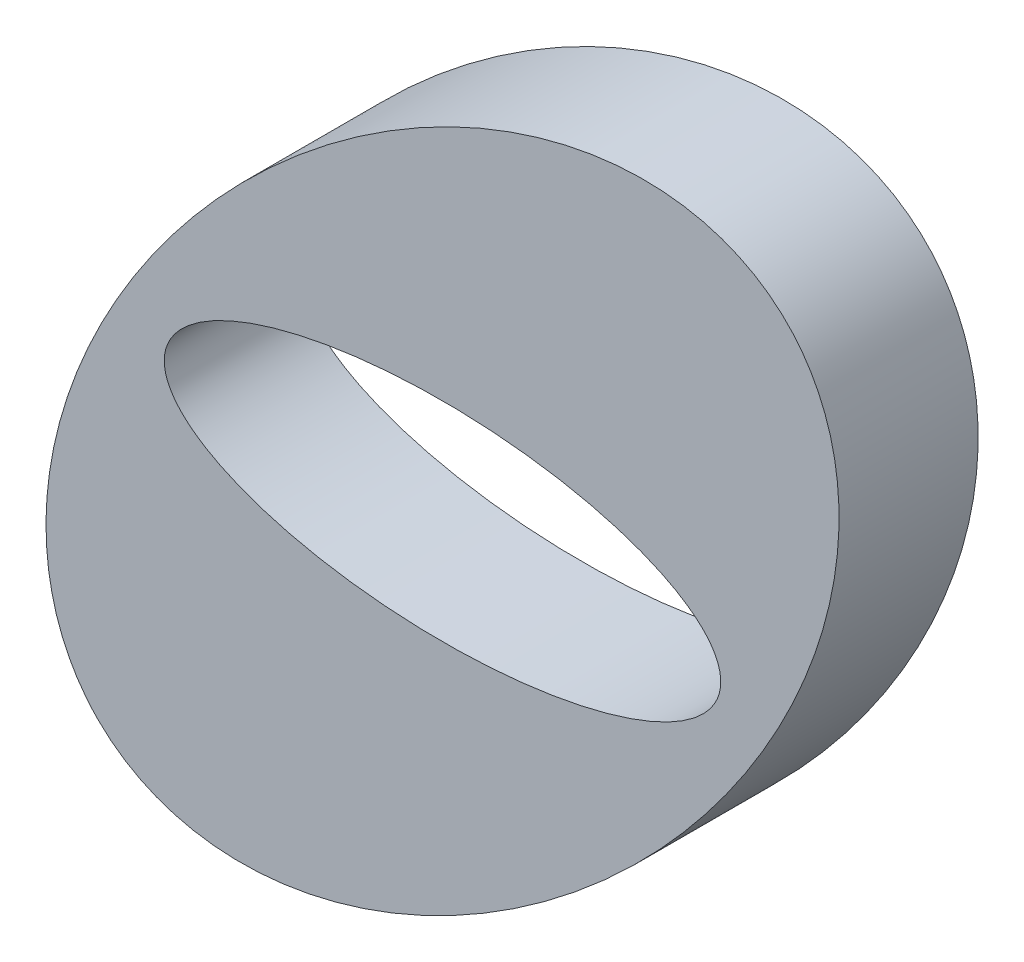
ISO-10303-21;
HEADER;
FILE_DESCRIPTION(('STEP AP214'),'2;1');
FILE_NAME('part.step','',(''),(''),'','','');
FILE_SCHEMA(('AUTOMOTIVE_DESIGN { 1 0 10303 214 1 1 1 1 }'));
ENDSEC;
DATA;
#1=APPLICATION_CONTEXT('core data for automotive mechanical design processes');
#2=APPLICATION_PROTOCOL_DEFINITION('international standard','automotive_design',2000,#1);
#3=PRODUCT_CONTEXT('',#1,'mechanical');
#4=PRODUCT('Part','Part','',(#3));
#5=PRODUCT_RELATED_PRODUCT_CATEGORY('part','',(#4));
#6=PRODUCT_DEFINITION_FORMATION('','',#4);
#7=PRODUCT_DEFINITION_CONTEXT('part definition',#1,'design');
#8=PRODUCT_DEFINITION('design','',#6,#7);
#9=PRODUCT_DEFINITION_SHAPE('','',#8);
#10=(LENGTH_UNIT() NAMED_UNIT(*) SI_UNIT(.MILLI.,.METRE.));
#11=(NAMED_UNIT(*) PLANE_ANGLE_UNIT() SI_UNIT($,.RADIAN.));
#12=(NAMED_UNIT(*) SI_UNIT($,.STERADIAN.) SOLID_ANGLE_UNIT());
#13=UNCERTAINTY_MEASURE_WITH_UNIT(LENGTH_MEASURE(1.E-05),#10,'distance_accuracy_value','');
#14=(GEOMETRIC_REPRESENTATION_CONTEXT(3) GLOBAL_UNCERTAINTY_ASSIGNED_CONTEXT((#13)) GLOBAL_UNIT_ASSIGNED_CONTEXT((#10,
#11,#12)) REPRESENTATION_CONTEXT('',''));
#15=CARTESIAN_POINT('',(0.,0.,0.));
#16=DIRECTION('',(0.,0.,1.));
#17=DIRECTION('',(1.,0.,0.));
#18=AXIS2_PLACEMENT_3D('',#15,#16,#17);
#19=CARTESIAN_POINT('',(0.,0.,20.));
#20=DIRECTION('',(0.,0.,1.));
#21=DIRECTION('',(1.,0.,0.));
#22=AXIS2_PLACEMENT_3D('',#19,#20,#21);
#23=PLANE('',#22);
#24=CARTESIAN_POINT('',(0.,0.,20.));
#25=DIRECTION('',(0.,0.,1.));
#26=DIRECTION('',(-0.707106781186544,-0.707106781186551,0.));
#27=AXIS2_PLACEMENT_3D('',#24,#25,#26);
#28=ELLIPSE('',#27,70.,40.);
#29=CARTESIAN_POINT('',(-49.4974746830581,-49.4974746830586,20.));
#30=VERTEX_POINT('',#29);
#31=EDGE_CURVE('E10',#30,#30,#28,.T.);
#32=ORIENTED_EDGE('',*,*,#31,.T.);
#33=EDGE_LOOP('',(#32));
#34=FACE_BOUND('',#33,.T.);
#35=CARTESIAN_POINT('',(0.,0.,20.));
#36=DIRECTION('',(0.,0.,1.));
#37=DIRECTION('',(1.,0.,0.));
#38=AXIS2_PLACEMENT_3D('',#35,#36,#37);
#39=ELLIPSE('',#38,40.,15.);
#40=CARTESIAN_POINT('',(40.,0.,20.));
#41=VERTEX_POINT('',#40);
#42=EDGE_CURVE('E43',#41,#41,#39,.T.);
#43=ORIENTED_EDGE('',*,*,#42,.F.);
#44=EDGE_LOOP('',(#43));
#45=FACE_BOUND('',#44,.T.);
#46=ADVANCED_FACE('F31',(#34,#45),#23,.T.);
#47=CARTESIAN_POINT('',(0.,0.,0.));
#48=DIRECTION('',(0.,0.,1.));
#49=DIRECTION('',(1.,0.,0.));
#50=AXIS2_PLACEMENT_3D('',#47,#48,#49);
#51=PLANE('',#50);
#52=CARTESIAN_POINT('',(0.,0.,0.));
#53=DIRECTION('',(0.,0.,1.));
#54=DIRECTION('',(-0.707106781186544,-0.707106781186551,0.));
#55=AXIS2_PLACEMENT_3D('',#52,#53,#54);
#56=ELLIPSE('',#55,70.,40.);
#57=CARTESIAN_POINT('',(-49.4974746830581,-49.4974746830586,0.));
#58=VERTEX_POINT('',#57);
#59=EDGE_CURVE('E39',#58,#58,#56,.T.);
#60=ORIENTED_EDGE('',*,*,#59,.F.);
#61=EDGE_LOOP('',(#60));
#62=FACE_BOUND('',#61,.T.);
#63=CARTESIAN_POINT('',(0.,0.,0.));
#64=DIRECTION('',(0.,0.,1.));
#65=DIRECTION('',(1.,0.,0.));
#66=AXIS2_PLACEMENT_3D('',#63,#64,#65);
#67=ELLIPSE('',#66,40.,15.);
#68=CARTESIAN_POINT('',(40.,0.,0.));
#69=VERTEX_POINT('',#68);
#70=EDGE_CURVE('E47',#69,#69,#67,.T.);
#71=ORIENTED_EDGE('',*,*,#70,.T.);
#72=EDGE_LOOP('',(#71));
#73=FACE_BOUND('',#72,.T.);
#74=ADVANCED_FACE('F56',(#62,#73),#51,.F.);
#75=DIRECTION('',(0.,0.,-1.));
#76=VECTOR('',#75,1.);
#77=SURFACE_OF_LINEAR_EXTRUSION('',#28,#76);
#78=ORIENTED_EDGE('',*,*,#31,.F.);
#79=EDGE_LOOP('',(#78));
#80=FACE_BOUND('',#79,.T.);
#81=ORIENTED_EDGE('',*,*,#59,.T.);
#82=EDGE_LOOP('',(#81));
#83=FACE_BOUND('',#82,.T.);
#84=ADVANCED_FACE('F33',(#80,#83),#77,.F.);
#85=DIRECTION('',(0.,0.,-1.));
#86=VECTOR('',#85,1.);
#87=SURFACE_OF_LINEAR_EXTRUSION('',#39,#86);
#88=ORIENTED_EDGE('',*,*,#42,.T.);
#89=EDGE_LOOP('',(#88));
#90=FACE_BOUND('',#89,.T.);
#91=ORIENTED_EDGE('',*,*,#70,.F.);
#92=EDGE_LOOP('',(#91));
#93=FACE_BOUND('',#92,.T.);
#94=ADVANCED_FACE('F52',(#90,#93),#87,.T.);
#95=CLOSED_SHELL('',(#46,#74,#84,#94));
#96=MANIFOLD_SOLID_BREP('B2',#95);
#97=ADVANCED_BREP_SHAPE_REPRESENTATION('',(#18,#96),#14);
#98=SHAPE_DEFINITION_REPRESENTATION(#9,#97);
ENDSEC;
END-ISO-10303-21;
